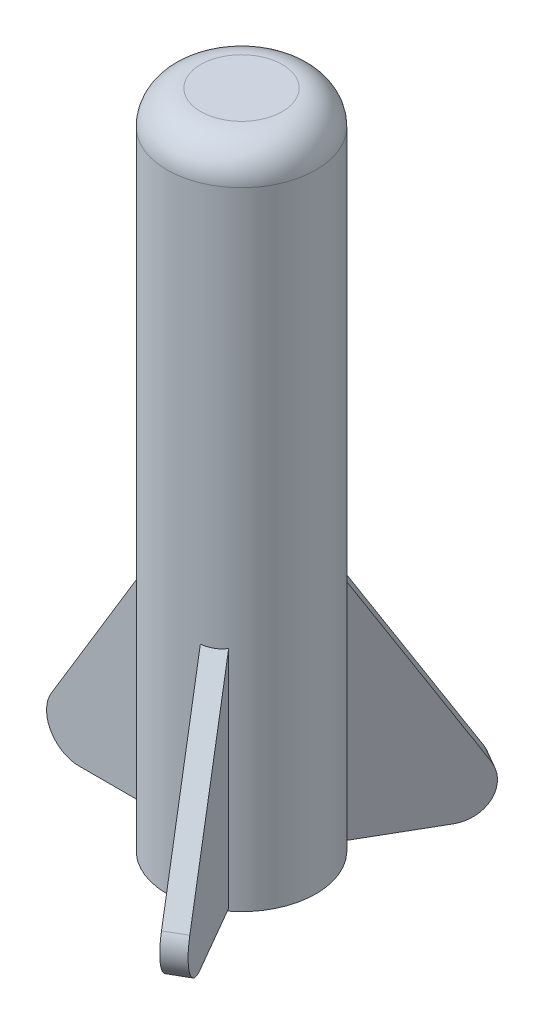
ISO-10303-21;
HEADER;
FILE_DESCRIPTION(('STEP AP214'),'2;1');
FILE_NAME('part.step','',(''),(''),'','','');
FILE_SCHEMA(('AUTOMOTIVE_DESIGN { 1 0 10303 214 1 1 1 1 }'));
ENDSEC;
DATA;
#1=APPLICATION_CONTEXT('core data for automotive mechanical design processes');
#2=APPLICATION_PROTOCOL_DEFINITION('international standard','automotive_design',2000,#1);
#3=PRODUCT_CONTEXT('',#1,'mechanical');
#4=PRODUCT('Part','Part','',(#3));
#5=PRODUCT_RELATED_PRODUCT_CATEGORY('part','',(#4));
#6=PRODUCT_DEFINITION_FORMATION('','',#4);
#7=PRODUCT_DEFINITION_CONTEXT('part definition',#1,'design');
#8=PRODUCT_DEFINITION('design','',#6,#7);
#9=PRODUCT_DEFINITION_SHAPE('','',#8);
#10=(LENGTH_UNIT() NAMED_UNIT(*) SI_UNIT(.MILLI.,.METRE.));
#11=(NAMED_UNIT(*) PLANE_ANGLE_UNIT() SI_UNIT($,.RADIAN.));
#12=(NAMED_UNIT(*) SI_UNIT($,.STERADIAN.) SOLID_ANGLE_UNIT());
#13=UNCERTAINTY_MEASURE_WITH_UNIT(LENGTH_MEASURE(1.E-05),#10,'distance_accuracy_value','');
#14=(GEOMETRIC_REPRESENTATION_CONTEXT(3) GLOBAL_UNCERTAINTY_ASSIGNED_CONTEXT((#13)) GLOBAL_UNIT_ASSIGNED_CONTEXT((#10,
#11,#12)) REPRESENTATION_CONTEXT('',''));
#15=CARTESIAN_POINT('',(0.,0.,0.));
#16=DIRECTION('',(0.,0.,1.));
#17=DIRECTION('',(1.,0.,0.));
#18=AXIS2_PLACEMENT_3D('',#15,#16,#17);
#19=CARTESIAN_POINT('',(0.,64.77,0.));
#20=DIRECTION('',(0.,-1.,0.));
#21=DIRECTION('',(0.,0.,-1.));
#22=AXIS2_PLACEMENT_3D('',#19,#20,#21);
#23=CYLINDRICAL_SURFACE('',#22,7.3025);
#24=DIRECTION('',(0.,-1.,0.));
#25=VECTOR('',#24,1.);
#26=CARTESIAN_POINT('',(2.73585636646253,64.77,-6.77064222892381));
#27=LINE('',#26,#25);
#28=CARTESIAN_POINT('',(2.73585636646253,0.254000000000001,-6.77064222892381));
#29=VERTEX_POINT('',#28);
#30=CARTESIAN_POINT('',(2.73585636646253,22.3030674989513,-6.77064222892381));
#31=VERTEX_POINT('',#30);
#32=EDGE_CURVE('E219',#29,#31,#27,.F.);
#33=ORIENTED_EDGE('',*,*,#32,.F.);
#34=CARTESIAN_POINT('',(0.,0.254000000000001,0.));
#35=DIRECTION('',(0.,-1.,0.));
#36=DIRECTION('',(0.,0.,-1.));
#37=AXIS2_PLACEMENT_3D('',#34,#35,#36);
#38=CIRCLE('',#37,7.3025);
#39=CARTESIAN_POINT('',(4.49561998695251,0.254000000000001,-5.75464222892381));
#40=VERTEX_POINT('',#39);
#41=EDGE_CURVE('E213',#29,#40,#38,.T.);
#42=ORIENTED_EDGE('',*,*,#41,.T.);
#43=DIRECTION('',(0.,-1.,0.));
#44=VECTOR('',#43,1.);
#45=CARTESIAN_POINT('',(4.49561998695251,64.77,-5.75464222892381));
#46=LINE('',#45,#44);
#47=CARTESIAN_POINT('',(4.4956199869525,22.3030674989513,-5.7546422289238));
#48=VERTEX_POINT('',#47);
#49=EDGE_CURVE('E210',#40,#48,#46,.F.);
#50=ORIENTED_EDGE('',*,*,#49,.T.);
#51=CARTESIAN_POINT('',(0.,34.275375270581,0.));
#52=DIRECTION('',(0.427986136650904,0.517021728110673,-0.741293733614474));
#53=DIRECTION('',(0.258510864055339,-0.855972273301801,-0.447753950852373));
#54=AXIS2_PLACEMENT_3D('',#51,#52,#53);
#55=ELLIPSE('',#54,14.1241646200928,7.3025);
#56=EDGE_CURVE('E216',#48,#31,#55,.T.);
#57=ORIENTED_EDGE('',*,*,#56,.T.);
#58=EDGE_LOOP('',(#33,#42,#50,#57));
#59=FACE_BOUND('',#58,.T.);
#60=CARTESIAN_POINT('',(0.,0.,0.));
#61=DIRECTION('',(0.,1.,0.));
#62=DIRECTION('',(0.,0.,1.));
#63=AXIS2_PLACEMENT_3D('',#60,#61,#62);
#64=CIRCLE('',#63,7.3025);
#65=CARTESIAN_POINT('',(0.,0.,7.3025));
#66=VERTEX_POINT('',#65);
#67=EDGE_CURVE('E190',#66,#66,#64,.T.);
#68=ORIENTED_EDGE('',*,*,#67,.T.);
#69=EDGE_LOOP('',(#68));
#70=FACE_BOUND('',#69,.T.);
#71=CARTESIAN_POINT('',(0.,61.468,0.));
#72=DIRECTION('',(0.,1.,0.));
#73=DIRECTION('',(0.,0.,1.));
#74=AXIS2_PLACEMENT_3D('',#71,#72,#73);
#75=CIRCLE('',#74,7.3025);
#76=CARTESIAN_POINT('',(0.,61.468,7.3025));
#77=VERTEX_POINT('',#76);
#78=EDGE_CURVE('E196',#77,#77,#75,.F.);
#79=ORIENTED_EDGE('',*,*,#78,.T.);
#80=EDGE_LOOP('',(#79));
#81=FACE_BOUND('',#80,.T.);
#82=DIRECTION('',(0.,-1.,0.));
#83=VECTOR('',#82,1.);
#84=CARTESIAN_POINT('',(-7.23147635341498,64.77,1.016));
#85=LINE('',#84,#83);
#86=CARTESIAN_POINT('',(-7.23147635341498,0.254000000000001,1.016));
#87=VERTEX_POINT('',#86);
#88=CARTESIAN_POINT('',(-7.23147635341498,22.3030674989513,1.016));
#89=VERTEX_POINT('',#88);
#90=EDGE_CURVE('E208',#87,#89,#85,.F.);
#91=ORIENTED_EDGE('',*,*,#90,.F.);
#92=CARTESIAN_POINT('',(0.,0.254000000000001,0.));
#93=DIRECTION('',(0.,-1.,0.));
#94=DIRECTION('',(0.,0.,-1.));
#95=AXIS2_PLACEMENT_3D('',#92,#93,#94);
#96=CIRCLE('',#95,7.3025);
#97=CARTESIAN_POINT('',(-7.23147635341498,0.254000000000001,-1.016));
#98=VERTEX_POINT('',#97);
#99=EDGE_CURVE('E202',#87,#98,#96,.T.);
#100=ORIENTED_EDGE('',*,*,#99,.T.);
#101=DIRECTION('',(0.,-1.,0.));
#102=VECTOR('',#101,1.);
#103=CARTESIAN_POINT('',(-7.23147635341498,64.77,-1.016));
#104=LINE('',#103,#102);
#105=CARTESIAN_POINT('',(-7.23147635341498,22.3030674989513,-1.016));
#106=VERTEX_POINT('',#105);
#107=EDGE_CURVE('E199',#98,#106,#104,.F.);
#108=ORIENTED_EDGE('',*,*,#107,.T.);
#109=CARTESIAN_POINT('',(0.,34.275375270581,0.));
#110=DIRECTION('',(-0.855972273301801,0.517021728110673,0.));
#111=DIRECTION('',(-0.517021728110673,-0.855972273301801,0.));
#112=AXIS2_PLACEMENT_3D('',#109,#110,#111);
#113=ELLIPSE('',#112,14.1241646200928,7.3025);
#114=EDGE_CURVE('E205',#106,#89,#113,.T.);
#115=ORIENTED_EDGE('',*,*,#114,.T.);
#116=EDGE_LOOP('',(#91,#100,#108,#115));
#117=FACE_BOUND('',#116,.T.);
#118=DIRECTION('',(0.,-1.,0.));
#119=VECTOR('',#118,1.);
#120=CARTESIAN_POINT('',(4.49561998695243,64.77,5.75464222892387));
#121=LINE('',#120,#119);
#122=CARTESIAN_POINT('',(4.49561998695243,0.254000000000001,5.75464222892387));
#123=VERTEX_POINT('',#122);
#124=CARTESIAN_POINT('',(4.49561998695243,22.3030674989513,5.75464222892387));
#125=VERTEX_POINT('',#124);
#126=EDGE_CURVE('E11',#123,#125,#121,.F.);
#127=ORIENTED_EDGE('',*,*,#126,.F.);
#128=CARTESIAN_POINT('',(0.,0.254000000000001,0.));
#129=DIRECTION('',(0.,-1.,0.));
#130=DIRECTION('',(0.,0.,-1.));
#131=AXIS2_PLACEMENT_3D('',#128,#129,#130);
#132=CIRCLE('',#131,7.3025);
#133=CARTESIAN_POINT('',(2.73585636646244,0.254000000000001,6.77064222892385));
#134=VERTEX_POINT('',#133);
#135=EDGE_CURVE('E222',#123,#134,#132,.T.);
#136=ORIENTED_EDGE('',*,*,#135,.T.);
#137=DIRECTION('',(0.,-1.,0.));
#138=VECTOR('',#137,1.);
#139=CARTESIAN_POINT('',(2.73585636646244,64.77,6.77064222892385));
#140=LINE('',#139,#138);
#141=CARTESIAN_POINT('',(2.73585636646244,22.3030674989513,6.77064222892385));
#142=VERTEX_POINT('',#141);
#143=EDGE_CURVE('E121',#134,#142,#140,.F.);
#144=ORIENTED_EDGE('',*,*,#143,.T.);
#145=CARTESIAN_POINT('',(0.,34.275375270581,0.));
#146=DIRECTION('',(0.427986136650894,0.517021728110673,0.74129373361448));
#147=DIRECTION('',(0.258510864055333,-0.855972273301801,0.447753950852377));
#148=AXIS2_PLACEMENT_3D('',#145,#146,#147);
#149=ELLIPSE('',#148,14.1241646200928,7.3025);
#150=EDGE_CURVE('E35',#142,#125,#149,.T.);
#151=ORIENTED_EDGE('',*,*,#150,.T.);
#152=EDGE_LOOP('',(#127,#136,#144,#151));
#153=FACE_BOUND('',#152,.T.);
#154=ADVANCED_FACE('F28',(#59,#70,#81,#117,#153),#23,.T.);
#155=CARTESIAN_POINT('',(0.,64.77,0.));
#156=DIRECTION('',(0.,1.,0.));
#157=DIRECTION('',(0.,0.,1.));
#158=AXIS2_PLACEMENT_3D('',#155,#156,#157);
#159=PLANE('',#158);
#160=CARTESIAN_POINT('',(0.,64.77,0.));
#161=DIRECTION('',(0.,1.,0.));
#162=DIRECTION('',(0.,0.,1.));
#163=AXIS2_PLACEMENT_3D('',#160,#161,#162);
#164=CIRCLE('',#163,4.0005);
#165=CARTESIAN_POINT('',(0.,64.77,4.0005));
#166=VERTEX_POINT('',#165);
#167=EDGE_CURVE('E193',#166,#166,#164,.T.);
#168=ORIENTED_EDGE('',*,*,#167,.T.);
#169=EDGE_LOOP('',(#168));
#170=FACE_BOUND('',#169,.T.);
#171=ADVANCED_FACE('F241',(#170),#159,.T.);
#172=CARTESIAN_POINT('',(0.,0.,0.));
#173=DIRECTION('',(0.,1.,0.));
#174=DIRECTION('',(0.,0.,1.));
#175=AXIS2_PLACEMENT_3D('',#172,#173,#174);
#176=PLANE('',#175);
#177=CARTESIAN_POINT('',(0.,0.,0.));
#178=DIRECTION('',(0.,-1.,0.));
#179=DIRECTION('',(0.,0.,-1.));
#180=AXIS2_PLACEMENT_3D('',#177,#178,#179);
#181=CIRCLE('',#180,2.794);
#182=CARTESIAN_POINT('',(0.,0.,-2.794));
#183=VERTEX_POINT('',#182);
#184=EDGE_CURVE('E182',#183,#183,#181,.T.);
#185=ORIENTED_EDGE('',*,*,#184,.F.);
#186=EDGE_LOOP('',(#185));
#187=FACE_BOUND('',#186,.T.);
#188=ORIENTED_EDGE('',*,*,#67,.F.);
#189=EDGE_LOOP('',(#188));
#190=FACE_BOUND('',#189,.T.);
#191=ADVANCED_FACE('F248',(#187,#190),#176,.F.);
#192=CARTESIAN_POINT('',(0.,61.468,0.));
#193=DIRECTION('',(0.,1.,0.));
#194=DIRECTION('',(0.,0.,1.));
#195=AXIS2_PLACEMENT_3D('',#192,#193,#194);
#196=TOROIDAL_SURFACE('',#195,4.0005,3.302);
#197=ORIENTED_EDGE('',*,*,#78,.F.);
#198=EDGE_LOOP('',(#197));
#199=FACE_BOUND('',#198,.T.);
#200=ORIENTED_EDGE('',*,*,#167,.F.);
#201=EDGE_LOOP('',(#200));
#202=FACE_BOUND('',#201,.T.);
#203=ADVANCED_FACE('F298',(#199,#202),#196,.T.);
#204=CARTESIAN_POINT('',(0.,34.29,0.));
#205=DIRECTION('',(0.,-1.,0.));
#206=DIRECTION('',(0.,0.,-1.));
#207=AXIS2_PLACEMENT_3D('',#204,#205,#206);
#208=CYLINDRICAL_SURFACE('',#207,2.794);
#209=CARTESIAN_POINT('',(0.,34.29,0.));
#210=DIRECTION('',(0.,-1.,0.));
#211=DIRECTION('',(0.,0.,-1.));
#212=AXIS2_PLACEMENT_3D('',#209,#210,#211);
#213=CIRCLE('',#212,2.794);
#214=CARTESIAN_POINT('',(0.,34.29,-2.794));
#215=VERTEX_POINT('',#214);
#216=EDGE_CURVE('E187',#215,#215,#213,.T.);
#217=ORIENTED_EDGE('',*,*,#216,.F.);
#218=EDGE_LOOP('',(#217));
#219=FACE_BOUND('',#218,.T.);
#220=ORIENTED_EDGE('',*,*,#184,.T.);
#221=EDGE_LOOP('',(#220));
#222=FACE_BOUND('',#221,.T.);
#223=ADVANCED_FACE('F294',(#219,#222),#208,.F.);
#224=CARTESIAN_POINT('',(0.,34.29,0.));
#225=DIRECTION('',(0.,-1.,0.));
#226=DIRECTION('',(0.,0.,-1.));
#227=AXIS2_PLACEMENT_3D('',#224,#225,#226);
#228=PLANE('',#227);
#229=ORIENTED_EDGE('',*,*,#216,.T.);
#230=EDGE_LOOP('',(#229));
#231=FACE_BOUND('',#230,.T.);
#232=ADVANCED_FACE('F288',(#231),#228,.T.);
#233=CARTESIAN_POINT('',(-17.6402119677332,5.07054398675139,1.016));
#234=DIRECTION('',(-0.855972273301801,0.517021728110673,0.));
#235=DIRECTION('',(-0.517021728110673,-0.855972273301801,0.));
#236=AXIS2_PLACEMENT_3D('',#233,#234,#235);
#237=PLANE('',#236);
#238=ORIENTED_EDGE('',*,*,#114,.F.);
#239=DIRECTION('',(0.517021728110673,0.855972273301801,0.));
#240=VECTOR('',#239,1.);
#241=CARTESIAN_POINT('',(-17.6402119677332,5.07054398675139,-1.016));
#242=LINE('',#241,#240);
#243=CARTESIAN_POINT('',(-17.6402119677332,5.07054398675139,-1.016));
#244=VERTEX_POINT('',#243);
#245=EDGE_CURVE('E169',#244,#106,#242,.T.);
#246=ORIENTED_EDGE('',*,*,#245,.F.);
#247=DIRECTION('',(0.,0.,-1.));
#248=VECTOR('',#247,1.);
#249=CARTESIAN_POINT('',(-17.6402119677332,5.07054398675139,1.016));
#250=LINE('',#249,#248);
#251=CARTESIAN_POINT('',(-17.6402119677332,5.07054398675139,1.016));
#252=VERTEX_POINT('',#251);
#253=EDGE_CURVE('E180',#252,#244,#250,.T.);
#254=ORIENTED_EDGE('',*,*,#253,.F.);
#255=DIRECTION('',(0.517021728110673,0.855972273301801,0.));
#256=VECTOR('',#255,1.);
#257=CARTESIAN_POINT('',(-17.6402119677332,5.07054398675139,1.016));
#258=LINE('',#257,#256);
#259=EDGE_CURVE('E176',#252,#89,#258,.T.);
#260=ORIENTED_EDGE('',*,*,#259,.T.);
#261=EDGE_LOOP('',(#238,#246,#254,#260));
#262=FACE_BOUND('',#261,.T.);
#263=ADVANCED_FACE('F264',(#262),#237,.T.);
#264=CARTESIAN_POINT('',(-7.0485,0.254000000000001,1.016));
#265=DIRECTION('',(0.,-1.,0.));
#266=DIRECTION('',(0.,0.,-1.));
#267=AXIS2_PLACEMENT_3D('',#264,#265,#266);
#268=PLANE('',#267);
#269=ORIENTED_EDGE('',*,*,#99,.F.);
#270=DIRECTION('',(-1.,0.,0.));
#271=VECTOR('',#270,1.);
#272=CARTESIAN_POINT('',(-7.0485,0.254000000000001,1.016));
#273=LINE('',#272,#271);
#274=CARTESIAN_POINT('',(-14.9225,0.254000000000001,1.016));
#275=VERTEX_POINT('',#274);
#276=EDGE_CURVE('E171',#87,#275,#273,.T.);
#277=ORIENTED_EDGE('',*,*,#276,.T.);
#278=DIRECTION('',(0.,0.,-1.));
#279=VECTOR('',#278,1.);
#280=CARTESIAN_POINT('',(-14.9225,0.254000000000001,1.016));
#281=LINE('',#280,#279);
#282=CARTESIAN_POINT('',(-14.9225,0.254000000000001,-1.016));
#283=VERTEX_POINT('',#282);
#284=EDGE_CURVE('E179',#275,#283,#281,.T.);
#285=ORIENTED_EDGE('',*,*,#284,.T.);
#286=DIRECTION('',(-1.,0.,0.));
#287=VECTOR('',#286,1.);
#288=CARTESIAN_POINT('',(-7.0485,0.254000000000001,-1.016));
#289=LINE('',#288,#287);
#290=EDGE_CURVE('E162',#98,#283,#289,.T.);
#291=ORIENTED_EDGE('',*,*,#290,.F.);
#292=EDGE_LOOP('',(#269,#277,#285,#291));
#293=FACE_BOUND('',#292,.T.);
#294=ADVANCED_FACE('F272',(#293),#268,.T.);
#295=CARTESIAN_POINT('',(-14.9225,3.429,1.016));
#296=DIRECTION('',(0.,0.,-1.));
#297=DIRECTION('',(-1.,0.,0.));
#298=AXIS2_PLACEMENT_3D('',#295,#296,#297);
#299=PLANE('',#298);
#300=ORIENTED_EDGE('',*,*,#276,.F.);
#301=ORIENTED_EDGE('',*,*,#90,.T.);
#302=ORIENTED_EDGE('',*,*,#259,.F.);
#303=CARTESIAN_POINT('',(-14.9225,3.429,1.016));
#304=DIRECTION('',(0.,0.,-1.));
#305=DIRECTION('',(-1.,0.,0.));
#306=AXIS2_PLACEMENT_3D('',#303,#304,#305);
#307=CIRCLE('',#306,3.175);
#308=EDGE_CURVE('E173',#275,#252,#307,.T.);
#309=ORIENTED_EDGE('',*,*,#308,.F.);
#310=EDGE_LOOP('',(#300,#301,#302,#309));
#311=FACE_BOUND('',#310,.T.);
#312=ADVANCED_FACE('F261',(#311),#299,.F.);
#313=CARTESIAN_POINT('',(-14.9225,3.429,-1.016));
#314=DIRECTION('',(0.,0.,-1.));
#315=DIRECTION('',(-1.,0.,0.));
#316=AXIS2_PLACEMENT_3D('',#313,#314,#315);
#317=PLANE('',#316);
#318=ORIENTED_EDGE('',*,*,#107,.F.);
#319=ORIENTED_EDGE('',*,*,#290,.T.);
#320=CARTESIAN_POINT('',(-14.9225,3.429,-1.016));
#321=DIRECTION('',(0.,0.,-1.));
#322=DIRECTION('',(-1.,0.,0.));
#323=AXIS2_PLACEMENT_3D('',#320,#321,#322);
#324=CIRCLE('',#323,3.175);
#325=EDGE_CURVE('E166',#283,#244,#324,.T.);
#326=ORIENTED_EDGE('',*,*,#325,.T.);
#327=ORIENTED_EDGE('',*,*,#245,.T.);
#328=EDGE_LOOP('',(#318,#319,#326,#327));
#329=FACE_BOUND('',#328,.T.);
#330=ADVANCED_FACE('F274',(#329),#317,.T.);
#331=CARTESIAN_POINT('',(-14.9225,3.429,1.016));
#332=DIRECTION('',(0.,0.,-1.));
#333=DIRECTION('',(-1.,0.,0.));
#334=AXIS2_PLACEMENT_3D('',#331,#332,#333);
#335=CYLINDRICAL_SURFACE('',#334,3.175);
#336=ORIENTED_EDGE('',*,*,#325,.F.);
#337=ORIENTED_EDGE('',*,*,#284,.F.);
#338=ORIENTED_EDGE('',*,*,#308,.T.);
#339=ORIENTED_EDGE('',*,*,#253,.T.);
#340=EDGE_LOOP('',(#336,#337,#338,#339));
#341=FACE_BOUND('',#340,.T.);
#342=ADVANCED_FACE('F269',(#341),#335,.T.);
#343=CARTESIAN_POINT('',(7.94022417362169,5.07054398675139,-15.7848716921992));
#344=DIRECTION('',(0.427986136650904,0.517021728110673,-0.741293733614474));
#345=DIRECTION('',(0.,0.820209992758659,0.572062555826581));
#346=AXIS2_PLACEMENT_3D('',#343,#344,#345);
#347=PLANE('',#346);
#348=ORIENTED_EDGE('',*,*,#56,.F.);
#349=DIRECTION('',(-0.258510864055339,0.855972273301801,0.447753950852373));
#350=VECTOR('',#349,1.);
#351=CARTESIAN_POINT('',(9.69998779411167,5.07054398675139,-14.7688716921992));
#352=LINE('',#351,#350);
#353=CARTESIAN_POINT('',(9.69998779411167,5.07054398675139,-14.7688716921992));
#354=VERTEX_POINT('',#353);
#355=EDGE_CURVE('E50',#354,#48,#352,.T.);
#356=ORIENTED_EDGE('',*,*,#355,.F.);
#357=DIRECTION('',(0.866025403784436,0.,0.500000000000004));
#358=VECTOR('',#357,1.);
#359=CARTESIAN_POINT('',(7.94022417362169,5.07054398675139,-15.7848716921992));
#360=LINE('',#359,#358);
#361=CARTESIAN_POINT('',(7.94022417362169,5.07054398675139,-15.7848716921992));
#362=VERTEX_POINT('',#361);
#363=EDGE_CURVE('E160',#362,#354,#360,.T.);
#364=ORIENTED_EDGE('',*,*,#363,.F.);
#365=DIRECTION('',(-0.258510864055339,0.855972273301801,0.447753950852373));
#366=VECTOR('',#365,1.);
#367=CARTESIAN_POINT('',(7.94022417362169,5.07054398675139,-15.7848716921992));
#368=LINE('',#367,#366);
#369=EDGE_CURVE('E156',#362,#31,#368,.T.);
#370=ORIENTED_EDGE('',*,*,#369,.T.);
#371=EDGE_LOOP('',(#348,#356,#364,#370));
#372=FACE_BOUND('',#371,.T.);
#373=ADVANCED_FACE('F280',(#372),#347,.T.);
#374=CARTESIAN_POINT('',(2.64436818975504,0.254000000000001,-6.61218005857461));
#375=DIRECTION('',(0.,-1.,0.));
#376=DIRECTION('',(0.,0.,-1.));
#377=AXIS2_PLACEMENT_3D('',#374,#375,#376);
#378=PLANE('',#377);
#379=ORIENTED_EDGE('',*,*,#41,.F.);
#380=DIRECTION('',(0.500000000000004,0.,-0.866025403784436));
#381=VECTOR('',#380,1.);
#382=CARTESIAN_POINT('',(2.64436818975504,0.254000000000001,-6.61218005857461));
#383=LINE('',#382,#381);
#384=CARTESIAN_POINT('',(6.58136818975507,0.254000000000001,-13.4312640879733));
#385=VERTEX_POINT('',#384);
#386=EDGE_CURVE('E151',#29,#385,#383,.T.);
#387=ORIENTED_EDGE('',*,*,#386,.T.);
#388=DIRECTION('',(0.866025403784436,0.,0.500000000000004));
#389=VECTOR('',#388,1.);
#390=CARTESIAN_POINT('',(6.58136818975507,0.254000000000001,-13.4312640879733));
#391=LINE('',#390,#389);
#392=CARTESIAN_POINT('',(8.34113181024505,0.254000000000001,-12.4152640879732));
#393=VERTEX_POINT('',#392);
#394=EDGE_CURVE('E159',#385,#393,#391,.T.);
#395=ORIENTED_EDGE('',*,*,#394,.T.);
#396=DIRECTION('',(0.500000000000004,0.,-0.866025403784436));
#397=VECTOR('',#396,1.);
#398=CARTESIAN_POINT('',(4.40413181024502,0.254000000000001,-5.5961800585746));
#399=LINE('',#398,#397);
#400=EDGE_CURVE('E145',#40,#393,#399,.T.);
#401=ORIENTED_EDGE('',*,*,#400,.F.);
#402=EDGE_LOOP('',(#379,#387,#395,#401));
#403=FACE_BOUND('',#402,.T.);
#404=ADVANCED_FACE('F284',(#403),#378,.T.);
#405=CARTESIAN_POINT('',(6.58136818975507,3.429,-13.4312640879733));
#406=DIRECTION('',(0.866025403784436,0.,0.500000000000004));
#407=DIRECTION('',(0.500000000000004,0.,-0.866025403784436));
#408=AXIS2_PLACEMENT_3D('',#405,#406,#407);
#409=PLANE('',#408);
#410=ORIENTED_EDGE('',*,*,#386,.F.);
#411=ORIENTED_EDGE('',*,*,#32,.T.);
#412=ORIENTED_EDGE('',*,*,#369,.F.);
#413=CARTESIAN_POINT('',(6.58136818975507,3.429,-13.4312640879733));
#414=DIRECTION('',(0.866025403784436,0.,0.500000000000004));
#415=DIRECTION('',(0.500000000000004,0.,-0.866025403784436));
#416=AXIS2_PLACEMENT_3D('',#413,#414,#415);
#417=CIRCLE('',#416,3.175);
#418=EDGE_CURVE('E153',#385,#362,#417,.T.);
#419=ORIENTED_EDGE('',*,*,#418,.F.);
#420=EDGE_LOOP('',(#410,#411,#412,#419));
#421=FACE_BOUND('',#420,.T.);
#422=ADVANCED_FACE('F354',(#421),#409,.F.);
#423=CARTESIAN_POINT('',(8.34113181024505,3.429,-12.4152640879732));
#424=DIRECTION('',(0.866025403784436,0.,0.500000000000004));
#425=DIRECTION('',(0.500000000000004,0.,-0.866025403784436));
#426=AXIS2_PLACEMENT_3D('',#423,#424,#425);
#427=PLANE('',#426);
#428=ORIENTED_EDGE('',*,*,#49,.F.);
#429=ORIENTED_EDGE('',*,*,#400,.T.);
#430=CARTESIAN_POINT('',(8.34113181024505,3.429,-12.4152640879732));
#431=DIRECTION('',(0.866025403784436,0.,0.500000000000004));
#432=DIRECTION('',(0.500000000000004,0.,-0.866025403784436));
#433=AXIS2_PLACEMENT_3D('',#430,#431,#432);
#434=CIRCLE('',#433,3.175);
#435=EDGE_CURVE('E148',#393,#354,#434,.T.);
#436=ORIENTED_EDGE('',*,*,#435,.T.);
#437=ORIENTED_EDGE('',*,*,#355,.T.);
#438=EDGE_LOOP('',(#428,#429,#436,#437));
#439=FACE_BOUND('',#438,.T.);
#440=ADVANCED_FACE('F361',(#439),#427,.T.);
#441=CARTESIAN_POINT('',(6.58136818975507,3.429,-13.4312640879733));
#442=DIRECTION('',(0.866025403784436,0.,0.500000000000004));
#443=DIRECTION('',(0.500000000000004,0.,-0.866025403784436));
#444=AXIS2_PLACEMENT_3D('',#441,#442,#443);
#445=CYLINDRICAL_SURFACE('',#444,3.175);
#446=ORIENTED_EDGE('',*,*,#435,.F.);
#447=ORIENTED_EDGE('',*,*,#394,.F.);
#448=ORIENTED_EDGE('',*,*,#418,.T.);
#449=ORIENTED_EDGE('',*,*,#363,.T.);
#450=EDGE_LOOP('',(#446,#447,#448,#449));
#451=FACE_BOUND('',#450,.T.);
#452=ADVANCED_FACE('F369',(#451),#445,.T.);
#453=CARTESIAN_POINT('',(9.69998779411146,5.07054398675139,14.7688716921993));
#454=DIRECTION('',(0.427986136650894,0.517021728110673,0.74129373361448));
#455=DIRECTION('',(0.,-0.820209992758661,0.572062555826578));
#456=AXIS2_PLACEMENT_3D('',#453,#454,#455);
#457=PLANE('',#456);
#458=ORIENTED_EDGE('',*,*,#150,.F.);
#459=DIRECTION('',(-0.258510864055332,0.855972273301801,-0.447753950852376));
#460=VECTOR('',#459,1.);
#461=CARTESIAN_POINT('',(7.94022417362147,5.07054398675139,15.7848716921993));
#462=LINE('',#461,#460);
#463=CARTESIAN_POINT('',(7.94022417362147,5.07054398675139,15.7848716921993));
#464=VERTEX_POINT('',#463);
#465=EDGE_CURVE('E42',#464,#142,#462,.T.);
#466=ORIENTED_EDGE('',*,*,#465,.F.);
#467=DIRECTION('',(-0.866025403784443,0.,0.499999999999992));
#468=VECTOR('',#467,1.);
#469=CARTESIAN_POINT('',(9.69998779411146,5.07054398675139,14.7688716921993));
#470=LINE('',#469,#468);
#471=CARTESIAN_POINT('',(9.69998779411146,5.07054398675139,14.7688716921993));
#472=VERTEX_POINT('',#471);
#473=EDGE_CURVE('E133',#472,#464,#470,.T.);
#474=ORIENTED_EDGE('',*,*,#473,.F.);
#475=DIRECTION('',(-0.258510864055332,0.855972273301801,-0.447753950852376));
#476=VECTOR('',#475,1.);
#477=CARTESIAN_POINT('',(9.69998779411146,5.07054398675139,14.7688716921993));
#478=LINE('',#477,#476);
#479=EDGE_CURVE('E134',#472,#125,#478,.T.);
#480=ORIENTED_EDGE('',*,*,#479,.T.);
#481=EDGE_LOOP('',(#458,#466,#474,#480));
#482=FACE_BOUND('',#481,.T.);
#483=ADVANCED_FACE('F227',(#482),#457,.T.);
#484=CARTESIAN_POINT('',(4.40413181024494,0.254000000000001,5.59618005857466));
#485=DIRECTION('',(0.,-1.,0.));
#486=DIRECTION('',(0.,0.,-1.));
#487=AXIS2_PLACEMENT_3D('',#484,#485,#486);
#488=PLANE('',#487);
#489=ORIENTED_EDGE('',*,*,#135,.F.);
#490=DIRECTION('',(0.499999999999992,0.,0.866025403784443));
#491=VECTOR('',#490,1.);
#492=CARTESIAN_POINT('',(4.40413181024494,0.254000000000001,5.59618005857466));
#493=LINE('',#492,#491);
#494=CARTESIAN_POINT('',(8.34113181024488,0.254000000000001,12.4152640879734));
#495=VERTEX_POINT('',#494);
#496=EDGE_CURVE('E129',#123,#495,#493,.T.);
#497=ORIENTED_EDGE('',*,*,#496,.T.);
#498=DIRECTION('',(-0.866025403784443,0.,0.499999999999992));
#499=VECTOR('',#498,1.);
#500=CARTESIAN_POINT('',(8.34113181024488,0.254000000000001,12.4152640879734));
#501=LINE('',#500,#499);
#502=CARTESIAN_POINT('',(6.58136818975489,0.254000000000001,13.4312640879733));
#503=VERTEX_POINT('',#502);
#504=EDGE_CURVE('E126',#495,#503,#501,.T.);
#505=ORIENTED_EDGE('',*,*,#504,.T.);
#506=DIRECTION('',(0.499999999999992,0.,0.866025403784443));
#507=VECTOR('',#506,1.);
#508=CARTESIAN_POINT('',(2.64436818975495,0.254000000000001,6.61218005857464));
#509=LINE('',#508,#507);
#510=EDGE_CURVE('E115',#134,#503,#509,.T.);
#511=ORIENTED_EDGE('',*,*,#510,.F.);
#512=EDGE_LOOP('',(#489,#497,#505,#511));
#513=FACE_BOUND('',#512,.T.);
#514=ADVANCED_FACE('F127',(#513),#488,.T.);
#515=CARTESIAN_POINT('',(8.34113181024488,3.429,12.4152640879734));
#516=DIRECTION('',(-0.866025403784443,0.,0.499999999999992));
#517=DIRECTION('',(0.499999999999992,0.,0.866025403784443));
#518=AXIS2_PLACEMENT_3D('',#515,#516,#517);
#519=PLANE('',#518);
#520=ORIENTED_EDGE('',*,*,#496,.F.);
#521=ORIENTED_EDGE('',*,*,#126,.T.);
#522=ORIENTED_EDGE('',*,*,#479,.F.);
#523=CARTESIAN_POINT('',(8.34113181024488,3.429,12.4152640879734));
#524=DIRECTION('',(-0.866025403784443,0.,0.499999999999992));
#525=DIRECTION('',(0.499999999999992,0.,0.866025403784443));
#526=AXIS2_PLACEMENT_3D('',#523,#524,#525);
#527=CIRCLE('',#526,3.175);
#528=EDGE_CURVE('E141',#495,#472,#527,.T.);
#529=ORIENTED_EDGE('',*,*,#528,.F.);
#530=EDGE_LOOP('',(#520,#521,#522,#529));
#531=FACE_BOUND('',#530,.T.);
#532=ADVANCED_FACE('F230',(#531),#519,.F.);
#533=CARTESIAN_POINT('',(6.58136818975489,3.429,13.4312640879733));
#534=DIRECTION('',(-0.866025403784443,0.,0.499999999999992));
#535=DIRECTION('',(0.499999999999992,0.,0.866025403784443));
#536=AXIS2_PLACEMENT_3D('',#533,#534,#535);
#537=PLANE('',#536);
#538=ORIENTED_EDGE('',*,*,#143,.F.);
#539=ORIENTED_EDGE('',*,*,#510,.T.);
#540=CARTESIAN_POINT('',(6.58136818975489,3.429,13.4312640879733));
#541=DIRECTION('',(-0.866025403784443,0.,0.499999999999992));
#542=DIRECTION('',(0.499999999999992,0.,0.866025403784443));
#543=AXIS2_PLACEMENT_3D('',#540,#541,#542);
#544=CIRCLE('',#543,3.175);
#545=EDGE_CURVE('E119',#503,#464,#544,.T.);
#546=ORIENTED_EDGE('',*,*,#545,.T.);
#547=ORIENTED_EDGE('',*,*,#465,.T.);
#548=EDGE_LOOP('',(#538,#539,#546,#547));
#549=FACE_BOUND('',#548,.T.);
#550=ADVANCED_FACE('F117',(#549),#537,.T.);
#551=CARTESIAN_POINT('',(8.34113181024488,3.429,12.4152640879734));
#552=DIRECTION('',(-0.866025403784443,0.,0.499999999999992));
#553=DIRECTION('',(0.499999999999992,0.,0.866025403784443));
#554=AXIS2_PLACEMENT_3D('',#551,#552,#553);
#555=CYLINDRICAL_SURFACE('',#554,3.175);
#556=ORIENTED_EDGE('',*,*,#545,.F.);
#557=ORIENTED_EDGE('',*,*,#504,.F.);
#558=ORIENTED_EDGE('',*,*,#528,.T.);
#559=ORIENTED_EDGE('',*,*,#473,.T.);
#560=EDGE_LOOP('',(#556,#557,#558,#559));
#561=FACE_BOUND('',#560,.T.);
#562=ADVANCED_FACE('F136',(#561),#555,.T.);
#563=CLOSED_SHELL('',(#154,#171,#191,#203,#223,#232,#263,#294,#312,#330,#342,#373,#404,#422,
#440,#452,#483,#514,#532,#550,#562));
#564=MANIFOLD_SOLID_BREP('B2',#563);
#565=ADVANCED_BREP_SHAPE_REPRESENTATION('',(#18,#564),#14);
#566=SHAPE_DEFINITION_REPRESENTATION(#9,#565);
ENDSEC;
END-ISO-10303-21;
